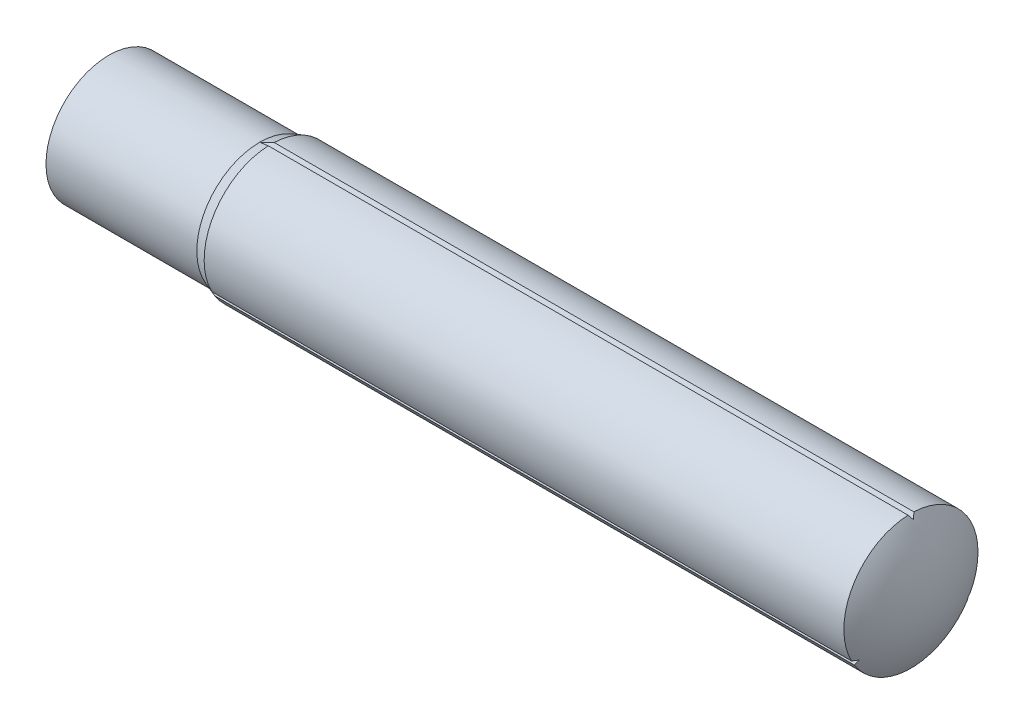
from build123d import *
from build123d.topology import SkipClean

# Parameters (mm, degrees)
CUT_EXTRUDE1_DEPTH = 11.0637965
CIRPATTERN1_COUNT  = 3


with BuildPart() as part:
    # Sketch1 → Base-Revolve (revolve)
    with BuildSketch(Plane.XY, mode=Mode.PRIVATE) as base_revolve_sk:
        with BuildLine():
            Line((0, 0), (10, 0))
            ThreePointArc((10, 0), (9.941056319, 0.416361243), (9.768857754, 0.8))
            Line((9.768857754, 0.8), (2.137373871, 0.8))
            Line((2.137373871, 0.8), (2, 0.75))
            Line((2, 0.75), (0.200961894, 0.75))
            ThreePointArc((0.200961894, 0.75), (0.051111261, 0.388228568), (0, 0))
        make_face()
    revolve(base_revolve_sk.sketch.rotate(Axis((-11.16342566, 0, 0), (1, 0, 0)), 90), axis=Axis((-11.16342566, 0, 0), (1, 0, 0)))

    # Sketch2 → Cut-Extrude1 (cut, through all)
    with SkipClean():  # the faces are left unmerged after this step: merging them gives an invalid solid
        with BuildSketch(Plane(origin=(0, 0, 0), x_dir=(0, 0, -1), z_dir=(1, 0, 0))):
            Polygon((-0.035010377, 0.8), (0, 0.75), (0.035010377, 0.8), align=None)
        cut_extrude1 = extrude(amount=CUT_EXTRUDE1_DEPTH, mode=Mode.SUBTRACT)

    # CirPattern1: Cut-Extrude1 ×3 about axis
    cirpattern1_axis = Axis((0, 0, 0), (1, 0, 0))
    for i in range(1, CIRPATTERN1_COUNT):
        add(cut_extrude1.rotate(cirpattern1_axis, i * 360 / CIRPATTERN1_COUNT), mode=Mode.SUBTRACT)


solid = part.part
